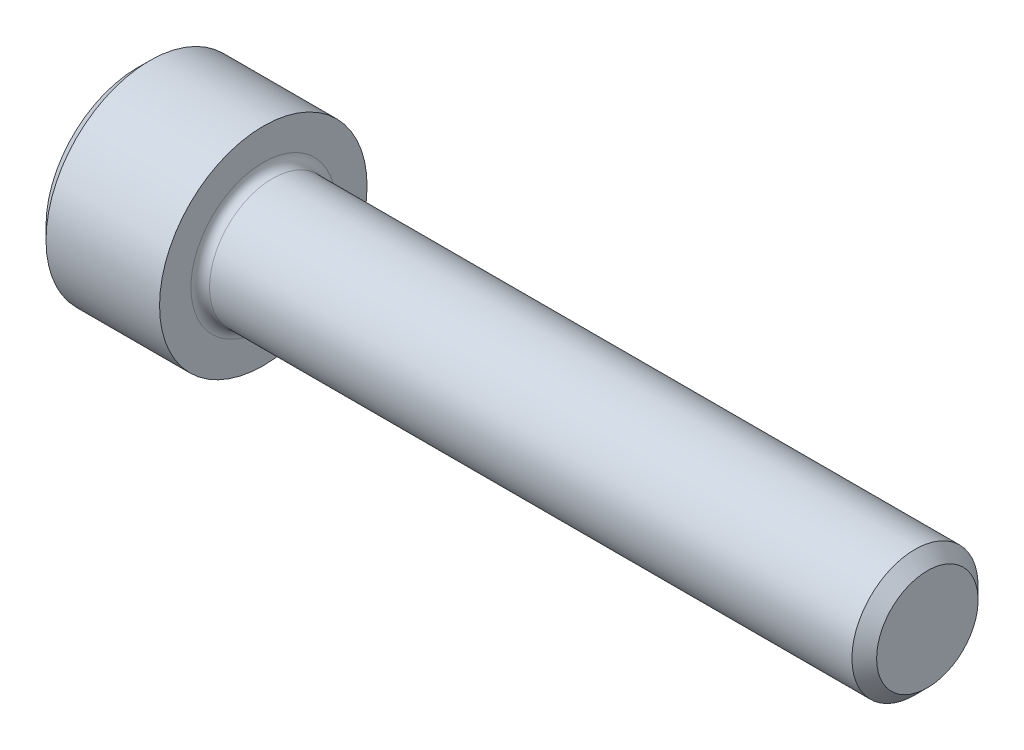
from build123d import *

# Parameters (mm, degrees)
FILLET1_R   = 0.3556
HEX_2_DEPTH = 2.286


with BuildPart() as part:
    # BodySke → Base-Revolve (revolve)
    with BuildSketch(Plane.XY, mode=Mode.PRIVATE) as base_revolve_sk:
        Polygon((0, 0), (0, 3.48615), (0.4826, 3.96875), (4.826, 3.96875), (4.826, 2.413), (29.75356, 2.413), (30.226, 1.94056), (30.226, 0), align=None)
    revolve(base_revolve_sk.sketch.rotate(Axis((-31.75, 0, 0), (1, 0, 0)), 90), axis=Axis((-31.75, 0, 0), (1, 0, 0)))

    # Fillet1
    fillet1_edges = [part.edges().sort_by_distance(p)[0] for p in [
        (4.826, 0, -2.413),
    ]]
    fillet(fillet1_edges, radius=FILLET1_R)

    # Sketch2 → Hex-PreBroach (revolve, cut)
    with BuildSketch(Plane.XY, mode=Mode.PRIVATE) as hex_prebroach_sk:
        Polygon((0, 1.98501), (2.286, 1.98501), (3.432046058, 0), (0, 0), align=None)
    revolve(hex_prebroach_sk.sketch.rotate(Axis((0, 0, 0), (1, 0, 0)), 90), axis=Axis((0, 0, 0), (1, 0, 0)), mode=Mode.SUBTRACT)

    # Sketch3 → Hex 2 (cut)
    with BuildSketch(Plane(origin=(0, 0, 0), x_dir=(0, 0.500000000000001, 0.866025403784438), z_dir=(-1, 0, 0))):
        Polygon((1.146046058, 1.98501), (-1.146046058, 1.98501), (-2.292092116, 0), (-1.146046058, -1.98501), (1.146046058, -1.98501), (2.292092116, 0), align=None)
    extrude(amount=-HEX_2_DEPTH, mode=Mode.SUBTRACT)


solid = part.part
